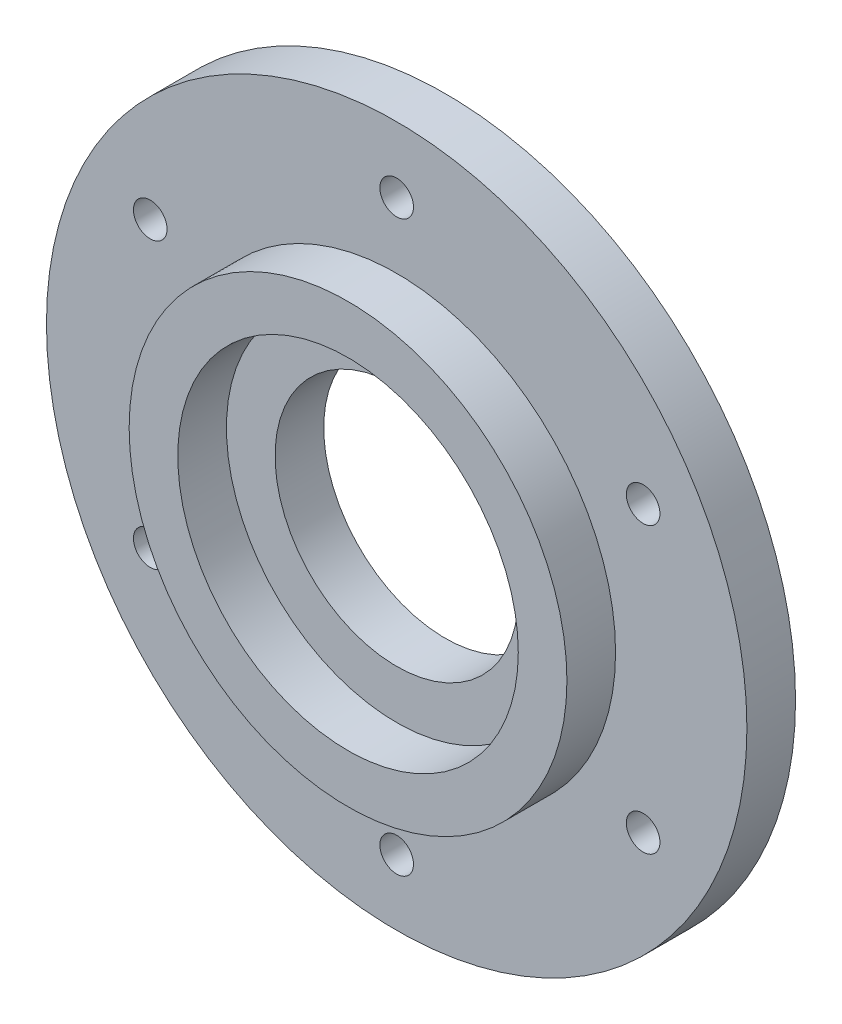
ISO-10303-21;
HEADER;
FILE_DESCRIPTION(('STEP AP214'),'2;1');
FILE_NAME('part.step','',(''),(''),'','','');
FILE_SCHEMA(('AUTOMOTIVE_DESIGN { 1 0 10303 214 1 1 1 1 }'));
ENDSEC;
DATA;
#1=APPLICATION_CONTEXT('core data for automotive mechanical design processes');
#2=APPLICATION_PROTOCOL_DEFINITION('international standard','automotive_design',2000,#1);
#3=PRODUCT_CONTEXT('',#1,'mechanical');
#4=PRODUCT('Part','Part','',(#3));
#5=PRODUCT_RELATED_PRODUCT_CATEGORY('part','',(#4));
#6=PRODUCT_DEFINITION_FORMATION('','',#4);
#7=PRODUCT_DEFINITION_CONTEXT('part definition',#1,'design');
#8=PRODUCT_DEFINITION('design','',#6,#7);
#9=PRODUCT_DEFINITION_SHAPE('','',#8);
#10=(LENGTH_UNIT() NAMED_UNIT(*) SI_UNIT(.MILLI.,.METRE.));
#11=(NAMED_UNIT(*) PLANE_ANGLE_UNIT() SI_UNIT($,.RADIAN.));
#12=(NAMED_UNIT(*) SI_UNIT($,.STERADIAN.) SOLID_ANGLE_UNIT());
#13=UNCERTAINTY_MEASURE_WITH_UNIT(LENGTH_MEASURE(1.E-05),#10,'distance_accuracy_value','');
#14=(GEOMETRIC_REPRESENTATION_CONTEXT(3) GLOBAL_UNCERTAINTY_ASSIGNED_CONTEXT((#13)) GLOBAL_UNIT_ASSIGNED_CONTEXT((#10,
#11,#12)) REPRESENTATION_CONTEXT('',''));
#15=CARTESIAN_POINT('',(0.,0.,0.));
#16=DIRECTION('',(0.,0.,1.));
#17=DIRECTION('',(1.,0.,0.));
#18=AXIS2_PLACEMENT_3D('',#15,#16,#17);
#19=CARTESIAN_POINT('',(0.,0.,1000.));
#20=DIRECTION('',(0.,0.,1.));
#21=DIRECTION('',(1.,0.,0.));
#22=AXIS2_PLACEMENT_3D('',#19,#20,#21);
#23=CYLINDRICAL_SURFACE('',#22,22.5);
#24=CARTESIAN_POINT('',(0.,0.,24.2));
#25=DIRECTION('',(0.,0.,1.));
#26=DIRECTION('',(1.,0.,0.));
#27=AXIS2_PLACEMENT_3D('',#24,#25,#26);
#28=CIRCLE('',#27,22.5);
#29=CARTESIAN_POINT('',(22.5,0.,24.2));
#30=VERTEX_POINT('',#29);
#31=EDGE_CURVE('E143',#30,#30,#28,.T.);
#32=ORIENTED_EDGE('',*,*,#31,.T.);
#33=EDGE_LOOP('',(#32));
#34=FACE_BOUND('',#33,.T.);
#35=CARTESIAN_POINT('',(0.,0.,29.2));
#36=DIRECTION('',(0.,0.,1.));
#37=DIRECTION('',(1.,0.,0.));
#38=AXIS2_PLACEMENT_3D('',#35,#36,#37);
#39=CIRCLE('',#38,22.5);
#40=CARTESIAN_POINT('',(22.5,0.,29.2));
#41=VERTEX_POINT('',#40);
#42=EDGE_CURVE('E10',#41,#41,#39,.T.);
#43=ORIENTED_EDGE('',*,*,#42,.F.);
#44=EDGE_LOOP('',(#43));
#45=FACE_BOUND('',#44,.T.);
#46=ADVANCED_FACE('F39',(#34,#45),#23,.T.);
#47=CARTESIAN_POINT('',(0.,0.,29.2));
#48=DIRECTION('',(0.,0.,1.));
#49=DIRECTION('',(1.,0.,0.));
#50=AXIS2_PLACEMENT_3D('',#47,#48,#49);
#51=PLANE('',#50);
#52=ORIENTED_EDGE('',*,*,#42,.T.);
#53=EDGE_LOOP('',(#52));
#54=FACE_BOUND('',#53,.T.);
#55=CARTESIAN_POINT('',(0.,0.,29.2));
#56=DIRECTION('',(0.,0.,1.));
#57=DIRECTION('',(1.,0.,0.));
#58=AXIS2_PLACEMENT_3D('',#55,#56,#57);
#59=CIRCLE('',#58,17.5);
#60=CARTESIAN_POINT('',(17.5,0.,29.2));
#61=VERTEX_POINT('',#60);
#62=EDGE_CURVE('E47',#61,#61,#59,.T.);
#63=ORIENTED_EDGE('',*,*,#62,.F.);
#64=EDGE_LOOP('',(#63));
#65=FACE_BOUND('',#64,.T.);
#66=ADVANCED_FACE('F165',(#54,#65),#51,.T.);
#67=CARTESIAN_POINT('',(0.,0.,1000.));
#68=DIRECTION('',(0.,0.,1.));
#69=DIRECTION('',(1.,0.,0.));
#70=AXIS2_PLACEMENT_3D('',#67,#68,#69);
#71=CYLINDRICAL_SURFACE('',#70,17.5);
#72=ORIENTED_EDGE('',*,*,#62,.T.);
#73=EDGE_LOOP('',(#72));
#74=FACE_BOUND('',#73,.T.);
#75=CARTESIAN_POINT('',(0.,0.,24.2));
#76=DIRECTION('',(0.,0.,1.));
#77=DIRECTION('',(1.,0.,0.));
#78=AXIS2_PLACEMENT_3D('',#75,#76,#77);
#79=CIRCLE('',#78,17.5);
#80=CARTESIAN_POINT('',(17.5,0.,24.2));
#81=VERTEX_POINT('',#80);
#82=EDGE_CURVE('E53',#81,#81,#79,.T.);
#83=ORIENTED_EDGE('',*,*,#82,.F.);
#84=EDGE_LOOP('',(#83));
#85=FACE_BOUND('',#84,.T.);
#86=ADVANCED_FACE('F163',(#74,#85),#71,.F.);
#87=CARTESIAN_POINT('',(0.,0.,24.2));
#88=DIRECTION('',(0.,0.,1.));
#89=DIRECTION('',(1.,0.,0.));
#90=AXIS2_PLACEMENT_3D('',#87,#88,#89);
#91=PLANE('',#90);
#92=CARTESIAN_POINT('',(0.,0.,24.2));
#93=DIRECTION('',(0.,0.,1.));
#94=DIRECTION('',(1.,0.,0.));
#95=AXIS2_PLACEMENT_3D('',#92,#93,#94);
#96=CIRCLE('',#95,12.5);
#97=CARTESIAN_POINT('',(12.5,0.,24.2));
#98=VERTEX_POINT('',#97);
#99=EDGE_CURVE('E61',#98,#98,#96,.T.);
#100=ORIENTED_EDGE('',*,*,#99,.F.);
#101=EDGE_LOOP('',(#100));
#102=FACE_BOUND('',#101,.T.);
#103=ORIENTED_EDGE('',*,*,#82,.T.);
#104=EDGE_LOOP('',(#103));
#105=FACE_BOUND('',#104,.T.);
#106=ADVANCED_FACE('F161',(#102,#105),#91,.T.);
#107=CARTESIAN_POINT('',(0.,0.,19.2));
#108=DIRECTION('',(0.,0.,-1.));
#109=DIRECTION('',(-1.,0.,0.));
#110=AXIS2_PLACEMENT_3D('',#107,#108,#109);
#111=PLANE('',#110);
#112=CARTESIAN_POINT('',(25.3312430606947,14.6250000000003,19.2));
#113=DIRECTION('',(0.,0.,-1.));
#114=DIRECTION('',(-1.,0.,0.));
#115=AXIS2_PLACEMENT_3D('',#112,#113,#114);
#116=CIRCLE('',#115,3.77063);
#117=CARTESIAN_POINT('',(21.5606130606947,14.6250000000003,19.2));
#118=VERTEX_POINT('',#117);
#119=EDGE_CURVE('E208',#118,#118,#116,.T.);
#120=ORIENTED_EDGE('',*,*,#119,.F.);
#121=EDGE_LOOP('',(#120));
#122=FACE_BOUND('',#121,.T.);
#123=CARTESIAN_POINT('',(25.331243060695,-14.6249999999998,19.2));
#124=DIRECTION('',(0.,0.,-1.));
#125=DIRECTION('',(-1.,0.,0.));
#126=AXIS2_PLACEMENT_3D('',#123,#124,#125);
#127=CIRCLE('',#126,3.77063);
#128=CARTESIAN_POINT('',(21.560613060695,-14.6249999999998,19.2));
#129=VERTEX_POINT('',#128);
#130=EDGE_CURVE('E99',#129,#129,#127,.T.);
#131=ORIENTED_EDGE('',*,*,#130,.F.);
#132=EDGE_LOOP('',(#131));
#133=FACE_BOUND('',#132,.T.);
#134=CARTESIAN_POINT('',(0.,-29.25,19.2));
#135=DIRECTION('',(0.,0.,-1.));
#136=DIRECTION('',(-1.,0.,0.));
#137=AXIS2_PLACEMENT_3D('',#134,#135,#136);
#138=CIRCLE('',#137,3.77063);
#139=CARTESIAN_POINT('',(-3.77063,-29.25,19.2));
#140=VERTEX_POINT('',#139);
#141=EDGE_CURVE('E83',#140,#140,#138,.T.);
#142=ORIENTED_EDGE('',*,*,#141,.F.);
#143=EDGE_LOOP('',(#142));
#144=FACE_BOUND('',#143,.T.);
#145=CARTESIAN_POINT('',(-25.3312430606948,-14.6250000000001,19.2));
#146=DIRECTION('',(0.,0.,-1.));
#147=DIRECTION('',(-1.,0.,0.));
#148=AXIS2_PLACEMENT_3D('',#145,#146,#147);
#149=CIRCLE('',#148,3.77063);
#150=CARTESIAN_POINT('',(-29.1018730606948,-14.6250000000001,19.2));
#151=VERTEX_POINT('',#150);
#152=EDGE_CURVE('E78',#151,#151,#149,.T.);
#153=ORIENTED_EDGE('',*,*,#152,.F.);
#154=EDGE_LOOP('',(#153));
#155=FACE_BOUND('',#154,.T.);
#156=CARTESIAN_POINT('',(-25.3312430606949,14.6249999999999,19.2));
#157=DIRECTION('',(0.,0.,-1.));
#158=DIRECTION('',(-1.,0.,0.));
#159=AXIS2_PLACEMENT_3D('',#156,#157,#158);
#160=CIRCLE('',#159,3.77063);
#161=CARTESIAN_POINT('',(-29.1018730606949,14.6249999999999,19.2));
#162=VERTEX_POINT('',#161);
#163=EDGE_CURVE('E73',#162,#162,#160,.T.);
#164=ORIENTED_EDGE('',*,*,#163,.F.);
#165=EDGE_LOOP('',(#164));
#166=FACE_BOUND('',#165,.T.);
#167=CARTESIAN_POINT('',(0.,29.25,19.2));
#168=DIRECTION('',(0.,0.,-1.));
#169=DIRECTION('',(-1.,0.,0.));
#170=AXIS2_PLACEMENT_3D('',#167,#168,#169);
#171=CIRCLE('',#170,3.77063);
#172=CARTESIAN_POINT('',(-3.77063,29.25,19.2));
#173=VERTEX_POINT('',#172);
#174=EDGE_CURVE('E67',#173,#173,#171,.T.);
#175=ORIENTED_EDGE('',*,*,#174,.F.);
#176=EDGE_LOOP('',(#175));
#177=FACE_BOUND('',#176,.T.);
#178=CARTESIAN_POINT('',(0.,0.,19.2));
#179=DIRECTION('',(0.,0.,1.));
#180=DIRECTION('',(1.,0.,0.));
#181=AXIS2_PLACEMENT_3D('',#178,#179,#180);
#182=CIRCLE('',#181,12.5);
#183=CARTESIAN_POINT('',(12.5,0.,19.2));
#184=VERTEX_POINT('',#183);
#185=EDGE_CURVE('E139',#184,#184,#182,.T.);
#186=ORIENTED_EDGE('',*,*,#185,.T.);
#187=EDGE_LOOP('',(#186));
#188=FACE_BOUND('',#187,.T.);
#189=CARTESIAN_POINT('',(0.,0.,19.2));
#190=DIRECTION('',(0.,0.,1.));
#191=DIRECTION('',(1.,0.,0.));
#192=AXIS2_PLACEMENT_3D('',#189,#190,#191);
#193=CIRCLE('',#192,36.);
#194=CARTESIAN_POINT('',(36.,0.,19.2));
#195=VERTEX_POINT('',#194);
#196=EDGE_CURVE('E154',#195,#195,#193,.T.);
#197=ORIENTED_EDGE('',*,*,#196,.F.);
#198=EDGE_LOOP('',(#197));
#199=FACE_BOUND('',#198,.T.);
#200=ADVANCED_FACE('F172',(#122,#133,#144,#155,#166,#177,#188,#199),#111,.T.);
#201=CARTESIAN_POINT('',(0.,0.,1000.));
#202=DIRECTION('',(0.,0.,1.));
#203=DIRECTION('',(1.,0.,0.));
#204=AXIS2_PLACEMENT_3D('',#201,#202,#203);
#205=CYLINDRICAL_SURFACE('',#204,36.);
#206=ORIENTED_EDGE('',*,*,#196,.T.);
#207=EDGE_LOOP('',(#206));
#208=FACE_BOUND('',#207,.T.);
#209=CARTESIAN_POINT('',(0.,0.,24.2));
#210=DIRECTION('',(0.,0.,1.));
#211=DIRECTION('',(1.,0.,0.));
#212=AXIS2_PLACEMENT_3D('',#209,#210,#211);
#213=CIRCLE('',#212,36.);
#214=CARTESIAN_POINT('',(36.,0.,24.2));
#215=VERTEX_POINT('',#214);
#216=EDGE_CURVE('E150',#215,#215,#213,.T.);
#217=ORIENTED_EDGE('',*,*,#216,.F.);
#218=EDGE_LOOP('',(#217));
#219=FACE_BOUND('',#218,.T.);
#220=ADVANCED_FACE('F185',(#208,#219),#205,.T.);
#221=CARTESIAN_POINT('',(0.,0.,24.2));
#222=DIRECTION('',(0.,0.,1.));
#223=DIRECTION('',(1.,0.,0.));
#224=AXIS2_PLACEMENT_3D('',#221,#222,#223);
#225=PLANE('',#224);
#226=CARTESIAN_POINT('',(25.3312430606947,14.6250000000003,24.2));
#227=DIRECTION('',(0.,0.,1.));
#228=DIRECTION('',(1.,0.,0.));
#229=AXIS2_PLACEMENT_3D('',#226,#227,#228);
#230=CIRCLE('',#229,1.7272);
#231=CARTESIAN_POINT('',(27.0584430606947,14.6250000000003,24.2));
#232=VERTEX_POINT('',#231);
#233=EDGE_CURVE('E42',#232,#232,#230,.T.);
#234=ORIENTED_EDGE('',*,*,#233,.F.);
#235=EDGE_LOOP('',(#234));
#236=FACE_BOUND('',#235,.T.);
#237=CARTESIAN_POINT('',(25.331243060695,-14.6249999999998,24.2));
#238=DIRECTION('',(0.,0.,1.));
#239=DIRECTION('',(1.,0.,0.));
#240=AXIS2_PLACEMENT_3D('',#237,#238,#239);
#241=CIRCLE('',#240,1.7272);
#242=CARTESIAN_POINT('',(27.058443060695,-14.6249999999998,24.2));
#243=VERTEX_POINT('',#242);
#244=EDGE_CURVE('E80',#243,#243,#241,.T.);
#245=ORIENTED_EDGE('',*,*,#244,.F.);
#246=EDGE_LOOP('',(#245));
#247=FACE_BOUND('',#246,.T.);
#248=CARTESIAN_POINT('',(0.,-29.25,24.2));
#249=DIRECTION('',(0.,0.,1.));
#250=DIRECTION('',(1.,0.,0.));
#251=AXIS2_PLACEMENT_3D('',#248,#249,#250);
#252=CIRCLE('',#251,1.7272);
#253=CARTESIAN_POINT('',(1.7272,-29.25,24.2));
#254=VERTEX_POINT('',#253);
#255=EDGE_CURVE('E75',#254,#254,#252,.T.);
#256=ORIENTED_EDGE('',*,*,#255,.F.);
#257=EDGE_LOOP('',(#256));
#258=FACE_BOUND('',#257,.T.);
#259=CARTESIAN_POINT('',(-25.3312430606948,-14.6250000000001,24.2));
#260=DIRECTION('',(0.,0.,1.));
#261=DIRECTION('',(1.,0.,0.));
#262=AXIS2_PLACEMENT_3D('',#259,#260,#261);
#263=CIRCLE('',#262,1.7272);
#264=CARTESIAN_POINT('',(-23.6040430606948,-14.6250000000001,24.2));
#265=VERTEX_POINT('',#264);
#266=EDGE_CURVE('E69',#265,#265,#263,.T.);
#267=ORIENTED_EDGE('',*,*,#266,.F.);
#268=EDGE_LOOP('',(#267));
#269=FACE_BOUND('',#268,.T.);
#270=CARTESIAN_POINT('',(-25.3312430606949,14.6249999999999,24.2));
#271=DIRECTION('',(0.,0.,1.));
#272=DIRECTION('',(1.,0.,0.));
#273=AXIS2_PLACEMENT_3D('',#270,#271,#272);
#274=CIRCLE('',#273,1.7272);
#275=CARTESIAN_POINT('',(-23.6040430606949,14.6249999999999,24.2));
#276=VERTEX_POINT('',#275);
#277=EDGE_CURVE('E63',#276,#276,#274,.T.);
#278=ORIENTED_EDGE('',*,*,#277,.F.);
#279=EDGE_LOOP('',(#278));
#280=FACE_BOUND('',#279,.T.);
#281=CARTESIAN_POINT('',(0.,29.25,24.2));
#282=DIRECTION('',(0.,0.,1.));
#283=DIRECTION('',(1.,0.,0.));
#284=AXIS2_PLACEMENT_3D('',#281,#282,#283);
#285=CIRCLE('',#284,1.7272);
#286=CARTESIAN_POINT('',(1.7272,29.25,24.2));
#287=VERTEX_POINT('',#286);
#288=EDGE_CURVE('E57',#287,#287,#285,.T.);
#289=ORIENTED_EDGE('',*,*,#288,.F.);
#290=EDGE_LOOP('',(#289));
#291=FACE_BOUND('',#290,.T.);
#292=ORIENTED_EDGE('',*,*,#216,.T.);
#293=EDGE_LOOP('',(#292));
#294=FACE_BOUND('',#293,.T.);
#295=ORIENTED_EDGE('',*,*,#31,.F.);
#296=EDGE_LOOP('',(#295));
#297=FACE_BOUND('',#296,.T.);
#298=ADVANCED_FACE('F182',(#236,#247,#258,#269,#280,#291,#294,#297),#225,.T.);
#299=CARTESIAN_POINT('',(0.,0.,19.2));
#300=DIRECTION('',(0.,0.,1.));
#301=DIRECTION('',(1.,0.,0.));
#302=AXIS2_PLACEMENT_3D('',#299,#300,#301);
#303=CYLINDRICAL_SURFACE('',#302,12.5);
#304=ORIENTED_EDGE('',*,*,#185,.F.);
#305=EDGE_LOOP('',(#304));
#306=FACE_BOUND('',#305,.T.);
#307=ORIENTED_EDGE('',*,*,#99,.T.);
#308=EDGE_LOOP('',(#307));
#309=FACE_BOUND('',#308,.T.);
#310=ADVANCED_FACE('F184',(#306,#309),#303,.F.);
#311=CARTESIAN_POINT('',(0.,29.25,19.2));
#312=DIRECTION('',(0.,0.,-1.));
#313=DIRECTION('',(-1.,0.,0.));
#314=AXIS2_PLACEMENT_3D('',#311,#312,#313);
#315=CYLINDRICAL_SURFACE('',#314,1.7272);
#316=ORIENTED_EDGE('',*,*,#288,.T.);
#317=EDGE_LOOP('',(#316));
#318=FACE_BOUND('',#317,.T.);
#319=CARTESIAN_POINT('',(0.,29.25,21.1812));
#320=DIRECTION('',(0.,0.,-1.));
#321=DIRECTION('',(-1.,0.,0.));
#322=AXIS2_PLACEMENT_3D('',#319,#320,#321);
#323=CIRCLE('',#322,1.7272);
#324=CARTESIAN_POINT('',(-1.7272,29.25,21.1812));
#325=VERTEX_POINT('',#324);
#326=EDGE_CURVE('E62',#325,#325,#323,.T.);
#327=ORIENTED_EDGE('',*,*,#326,.T.);
#328=EDGE_LOOP('',(#327));
#329=FACE_BOUND('',#328,.T.);
#330=ADVANCED_FACE('F192',(#318,#329),#315,.F.);
#331=CARTESIAN_POINT('',(1.7272,29.25,21.1812));
#332=DIRECTION('',(0.,0.,1.));
#333=DIRECTION('',(1.,0.,0.));
#334=AXIS2_PLACEMENT_3D('',#331,#332,#333);
#335=PLANE('',#334);
#336=ORIENTED_EDGE('',*,*,#326,.F.);
#337=EDGE_LOOP('',(#336));
#338=FACE_BOUND('',#337,.T.);
#339=CARTESIAN_POINT('',(0.,29.25,21.1812));
#340=DIRECTION('',(0.,0.,-1.));
#341=DIRECTION('',(-1.,0.,0.));
#342=AXIS2_PLACEMENT_3D('',#339,#340,#341);
#343=CIRCLE('',#342,3.77063);
#344=CARTESIAN_POINT('',(-3.77063,29.25,21.1812));
#345=VERTEX_POINT('',#344);
#346=EDGE_CURVE('E132',#345,#345,#343,.T.);
#347=ORIENTED_EDGE('',*,*,#346,.T.);
#348=EDGE_LOOP('',(#347));
#349=FACE_BOUND('',#348,.T.);
#350=ADVANCED_FACE('F232',(#338,#349),#335,.F.);
#351=CARTESIAN_POINT('',(0.,29.25,19.2));
#352=DIRECTION('',(0.,0.,-1.));
#353=DIRECTION('',(-1.,0.,0.));
#354=AXIS2_PLACEMENT_3D('',#351,#352,#353);
#355=CYLINDRICAL_SURFACE('',#354,3.77063);
#356=ORIENTED_EDGE('',*,*,#346,.F.);
#357=EDGE_LOOP('',(#356));
#358=FACE_BOUND('',#357,.T.);
#359=ORIENTED_EDGE('',*,*,#174,.T.);
#360=EDGE_LOOP('',(#359));
#361=FACE_BOUND('',#360,.T.);
#362=ADVANCED_FACE('F229',(#358,#361),#355,.F.);
#363=CARTESIAN_POINT('',(-25.3312430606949,14.6249999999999,19.2));
#364=DIRECTION('',(0.,0.,-1.));
#365=DIRECTION('',(-1.,0.,0.));
#366=AXIS2_PLACEMENT_3D('',#363,#364,#365);
#367=CYLINDRICAL_SURFACE('',#366,1.7272);
#368=ORIENTED_EDGE('',*,*,#277,.T.);
#369=EDGE_LOOP('',(#368));
#370=FACE_BOUND('',#369,.T.);
#371=CARTESIAN_POINT('',(-25.3312430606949,14.6249999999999,21.1812));
#372=DIRECTION('',(0.,0.,-1.));
#373=DIRECTION('',(-1.,0.,0.));
#374=AXIS2_PLACEMENT_3D('',#371,#372,#373);
#375=CIRCLE('',#374,1.7272);
#376=CARTESIAN_POINT('',(-27.0584430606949,14.6249999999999,21.1812));
#377=VERTEX_POINT('',#376);
#378=EDGE_CURVE('E68',#377,#377,#375,.T.);
#379=ORIENTED_EDGE('',*,*,#378,.T.);
#380=EDGE_LOOP('',(#379));
#381=FACE_BOUND('',#380,.T.);
#382=ADVANCED_FACE('F231',(#370,#381),#367,.F.);
#383=CARTESIAN_POINT('',(-23.6040430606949,14.6249999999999,21.1812));
#384=DIRECTION('',(0.,0.,1.));
#385=DIRECTION('',(1.,0.,0.));
#386=AXIS2_PLACEMENT_3D('',#383,#384,#385);
#387=PLANE('',#386);
#388=ORIENTED_EDGE('',*,*,#378,.F.);
#389=EDGE_LOOP('',(#388));
#390=FACE_BOUND('',#389,.T.);
#391=CARTESIAN_POINT('',(-25.3312430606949,14.6249999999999,21.1812));
#392=DIRECTION('',(0.,0.,-1.));
#393=DIRECTION('',(-1.,0.,0.));
#394=AXIS2_PLACEMENT_3D('',#391,#392,#393);
#395=CIRCLE('',#394,3.77063);
#396=CARTESIAN_POINT('',(-29.1018730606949,14.6249999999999,21.1812));
#397=VERTEX_POINT('',#396);
#398=EDGE_CURVE('E122',#397,#397,#395,.T.);
#399=ORIENTED_EDGE('',*,*,#398,.T.);
#400=EDGE_LOOP('',(#399));
#401=FACE_BOUND('',#400,.T.);
#402=ADVANCED_FACE('F239',(#390,#401),#387,.F.);
#403=CARTESIAN_POINT('',(-25.3312430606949,14.6249999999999,19.2));
#404=DIRECTION('',(0.,0.,-1.));
#405=DIRECTION('',(-1.,0.,0.));
#406=AXIS2_PLACEMENT_3D('',#403,#404,#405);
#407=CYLINDRICAL_SURFACE('',#406,3.77063);
#408=ORIENTED_EDGE('',*,*,#398,.F.);
#409=EDGE_LOOP('',(#408));
#410=FACE_BOUND('',#409,.T.);
#411=ORIENTED_EDGE('',*,*,#163,.T.);
#412=EDGE_LOOP('',(#411));
#413=FACE_BOUND('',#412,.T.);
#414=ADVANCED_FACE('F291',(#410,#413),#407,.F.);
#415=CARTESIAN_POINT('',(-25.3312430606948,-14.6250000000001,19.2));
#416=DIRECTION('',(0.,0.,-1.));
#417=DIRECTION('',(-1.,0.,0.));
#418=AXIS2_PLACEMENT_3D('',#415,#416,#417);
#419=CYLINDRICAL_SURFACE('',#418,1.7272);
#420=ORIENTED_EDGE('',*,*,#266,.T.);
#421=EDGE_LOOP('',(#420));
#422=FACE_BOUND('',#421,.T.);
#423=CARTESIAN_POINT('',(-25.3312430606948,-14.6250000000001,21.1812));
#424=DIRECTION('',(0.,0.,-1.));
#425=DIRECTION('',(-1.,0.,0.));
#426=AXIS2_PLACEMENT_3D('',#423,#424,#425);
#427=CIRCLE('',#426,1.7272);
#428=CARTESIAN_POINT('',(-27.0584430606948,-14.6250000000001,21.1812));
#429=VERTEX_POINT('',#428);
#430=EDGE_CURVE('E74',#429,#429,#427,.T.);
#431=ORIENTED_EDGE('',*,*,#430,.T.);
#432=EDGE_LOOP('',(#431));
#433=FACE_BOUND('',#432,.T.);
#434=ADVANCED_FACE('F300',(#422,#433),#419,.F.);
#435=CARTESIAN_POINT('',(-23.6040430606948,-14.6250000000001,21.1812));
#436=DIRECTION('',(0.,0.,1.));
#437=DIRECTION('',(1.,0.,0.));
#438=AXIS2_PLACEMENT_3D('',#435,#436,#437);
#439=PLANE('',#438);
#440=ORIENTED_EDGE('',*,*,#430,.F.);
#441=EDGE_LOOP('',(#440));
#442=FACE_BOUND('',#441,.T.);
#443=CARTESIAN_POINT('',(-25.3312430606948,-14.6250000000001,21.1812));
#444=DIRECTION('',(0.,0.,-1.));
#445=DIRECTION('',(-1.,0.,0.));
#446=AXIS2_PLACEMENT_3D('',#443,#444,#445);
#447=CIRCLE('',#446,3.77063);
#448=CARTESIAN_POINT('',(-29.1018730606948,-14.6250000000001,21.1812));
#449=VERTEX_POINT('',#448);
#450=EDGE_CURVE('E112',#449,#449,#447,.T.);
#451=ORIENTED_EDGE('',*,*,#450,.T.);
#452=EDGE_LOOP('',(#451));
#453=FACE_BOUND('',#452,.T.);
#454=ADVANCED_FACE('F310',(#442,#453),#439,.F.);
#455=CARTESIAN_POINT('',(-25.3312430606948,-14.6250000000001,19.2));
#456=DIRECTION('',(0.,0.,-1.));
#457=DIRECTION('',(-1.,0.,0.));
#458=AXIS2_PLACEMENT_3D('',#455,#456,#457);
#459=CYLINDRICAL_SURFACE('',#458,3.77063);
#460=ORIENTED_EDGE('',*,*,#450,.F.);
#461=EDGE_LOOP('',(#460));
#462=FACE_BOUND('',#461,.T.);
#463=ORIENTED_EDGE('',*,*,#152,.T.);
#464=EDGE_LOOP('',(#463));
#465=FACE_BOUND('',#464,.T.);
#466=ADVANCED_FACE('F320',(#462,#465),#459,.F.);
#467=CARTESIAN_POINT('',(0.,-29.25,19.2));
#468=DIRECTION('',(0.,0.,-1.));
#469=DIRECTION('',(-1.,0.,0.));
#470=AXIS2_PLACEMENT_3D('',#467,#468,#469);
#471=CYLINDRICAL_SURFACE('',#470,1.7272);
#472=ORIENTED_EDGE('',*,*,#255,.T.);
#473=EDGE_LOOP('',(#472));
#474=FACE_BOUND('',#473,.T.);
#475=CARTESIAN_POINT('',(0.,-29.25,21.1812));
#476=DIRECTION('',(0.,0.,-1.));
#477=DIRECTION('',(-1.,0.,0.));
#478=AXIS2_PLACEMENT_3D('',#475,#476,#477);
#479=CIRCLE('',#478,1.7272);
#480=CARTESIAN_POINT('',(-1.7272,-29.25,21.1812));
#481=VERTEX_POINT('',#480);
#482=EDGE_CURVE('E79',#481,#481,#479,.T.);
#483=ORIENTED_EDGE('',*,*,#482,.T.);
#484=EDGE_LOOP('',(#483));
#485=FACE_BOUND('',#484,.T.);
#486=ADVANCED_FACE('F330',(#474,#485),#471,.F.);
#487=CARTESIAN_POINT('',(1.7272,-29.25,21.1812));
#488=DIRECTION('',(0.,0.,1.));
#489=DIRECTION('',(1.,0.,0.));
#490=AXIS2_PLACEMENT_3D('',#487,#488,#489);
#491=PLANE('',#490);
#492=ORIENTED_EDGE('',*,*,#482,.F.);
#493=EDGE_LOOP('',(#492));
#494=FACE_BOUND('',#493,.T.);
#495=CARTESIAN_POINT('',(0.,-29.25,21.1812));
#496=DIRECTION('',(0.,0.,-1.));
#497=DIRECTION('',(-1.,0.,0.));
#498=AXIS2_PLACEMENT_3D('',#495,#496,#497);
#499=CIRCLE('',#498,3.77063);
#500=CARTESIAN_POINT('',(-3.77063,-29.25,21.1812));
#501=VERTEX_POINT('',#500);
#502=EDGE_CURVE('E90',#501,#501,#499,.T.);
#503=ORIENTED_EDGE('',*,*,#502,.T.);
#504=EDGE_LOOP('',(#503));
#505=FACE_BOUND('',#504,.T.);
#506=ADVANCED_FACE('F340',(#494,#505),#491,.F.);
#507=CARTESIAN_POINT('',(0.,-29.25,19.2));
#508=DIRECTION('',(0.,0.,-1.));
#509=DIRECTION('',(-1.,0.,0.));
#510=AXIS2_PLACEMENT_3D('',#507,#508,#509);
#511=CYLINDRICAL_SURFACE('',#510,3.77063);
#512=ORIENTED_EDGE('',*,*,#502,.F.);
#513=EDGE_LOOP('',(#512));
#514=FACE_BOUND('',#513,.T.);
#515=ORIENTED_EDGE('',*,*,#141,.T.);
#516=EDGE_LOOP('',(#515));
#517=FACE_BOUND('',#516,.T.);
#518=ADVANCED_FACE('F350',(#514,#517),#511,.F.);
#519=CARTESIAN_POINT('',(25.331243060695,-14.6249999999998,19.2));
#520=DIRECTION('',(0.,0.,-1.));
#521=DIRECTION('',(-1.,0.,0.));
#522=AXIS2_PLACEMENT_3D('',#519,#520,#521);
#523=CYLINDRICAL_SURFACE('',#522,1.7272);
#524=ORIENTED_EDGE('',*,*,#244,.T.);
#525=EDGE_LOOP('',(#524));
#526=FACE_BOUND('',#525,.T.);
#527=CARTESIAN_POINT('',(25.331243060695,-14.6249999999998,21.1812));
#528=DIRECTION('',(0.,0.,-1.));
#529=DIRECTION('',(-1.,0.,0.));
#530=AXIS2_PLACEMENT_3D('',#527,#528,#529);
#531=CIRCLE('',#530,1.7272);
#532=CARTESIAN_POINT('',(23.604043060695,-14.6249999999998,21.1812));
#533=VERTEX_POINT('',#532);
#534=EDGE_CURVE('E84',#533,#533,#531,.T.);
#535=ORIENTED_EDGE('',*,*,#534,.T.);
#536=EDGE_LOOP('',(#535));
#537=FACE_BOUND('',#536,.T.);
#538=ADVANCED_FACE('F360',(#526,#537),#523,.F.);
#539=CARTESIAN_POINT('',(27.058443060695,-14.6249999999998,21.1812));
#540=DIRECTION('',(0.,0.,1.));
#541=DIRECTION('',(1.,0.,0.));
#542=AXIS2_PLACEMENT_3D('',#539,#540,#541);
#543=PLANE('',#542);
#544=ORIENTED_EDGE('',*,*,#534,.F.);
#545=EDGE_LOOP('',(#544));
#546=FACE_BOUND('',#545,.T.);
#547=CARTESIAN_POINT('',(25.331243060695,-14.6249999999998,21.1812));
#548=DIRECTION('',(0.,0.,-1.));
#549=DIRECTION('',(-1.,0.,0.));
#550=AXIS2_PLACEMENT_3D('',#547,#548,#549);
#551=CIRCLE('',#550,3.77063);
#552=CARTESIAN_POINT('',(21.560613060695,-14.6249999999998,21.1812));
#553=VERTEX_POINT('',#552);
#554=EDGE_CURVE('E93',#553,#553,#551,.T.);
#555=ORIENTED_EDGE('',*,*,#554,.T.);
#556=EDGE_LOOP('',(#555));
#557=FACE_BOUND('',#556,.T.);
#558=ADVANCED_FACE('F370',(#546,#557),#543,.F.);
#559=CARTESIAN_POINT('',(25.331243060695,-14.6249999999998,19.2));
#560=DIRECTION('',(0.,0.,-1.));
#561=DIRECTION('',(-1.,0.,0.));
#562=AXIS2_PLACEMENT_3D('',#559,#560,#561);
#563=CYLINDRICAL_SURFACE('',#562,3.77063);
#564=ORIENTED_EDGE('',*,*,#554,.F.);
#565=EDGE_LOOP('',(#564));
#566=FACE_BOUND('',#565,.T.);
#567=ORIENTED_EDGE('',*,*,#130,.T.);
#568=EDGE_LOOP('',(#567));
#569=FACE_BOUND('',#568,.T.);
#570=ADVANCED_FACE('F379',(#566,#569),#563,.F.);
#571=CARTESIAN_POINT('',(25.3312430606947,14.6250000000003,19.2));
#572=DIRECTION('',(0.,0.,-1.));
#573=DIRECTION('',(-1.,0.,0.));
#574=AXIS2_PLACEMENT_3D('',#571,#572,#573);
#575=CYLINDRICAL_SURFACE('',#574,1.7272);
#576=ORIENTED_EDGE('',*,*,#233,.T.);
#577=EDGE_LOOP('',(#576));
#578=FACE_BOUND('',#577,.T.);
#579=CARTESIAN_POINT('',(25.3312430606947,14.6250000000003,21.1812));
#580=DIRECTION('',(0.,0.,-1.));
#581=DIRECTION('',(-1.,0.,0.));
#582=AXIS2_PLACEMENT_3D('',#579,#580,#581);
#583=CIRCLE('',#582,1.7272);
#584=CARTESIAN_POINT('',(23.6040430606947,14.6250000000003,21.1812));
#585=VERTEX_POINT('',#584);
#586=EDGE_CURVE('E430',#585,#585,#583,.T.);
#587=ORIENTED_EDGE('',*,*,#586,.T.);
#588=EDGE_LOOP('',(#587));
#589=FACE_BOUND('',#588,.T.);
#590=ADVANCED_FACE('F389',(#578,#589),#575,.F.);
#591=CARTESIAN_POINT('',(27.0584430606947,14.6250000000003,21.1812));
#592=DIRECTION('',(0.,0.,1.));
#593=DIRECTION('',(1.,0.,0.));
#594=AXIS2_PLACEMENT_3D('',#591,#592,#593);
#595=PLANE('',#594);
#596=ORIENTED_EDGE('',*,*,#586,.F.);
#597=EDGE_LOOP('',(#596));
#598=FACE_BOUND('',#597,.T.);
#599=CARTESIAN_POINT('',(25.3312430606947,14.6250000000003,21.1812));
#600=DIRECTION('',(0.,0.,-1.));
#601=DIRECTION('',(-1.,0.,0.));
#602=AXIS2_PLACEMENT_3D('',#599,#600,#601);
#603=CIRCLE('',#602,3.77063);
#604=CARTESIAN_POINT('',(21.5606130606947,14.6250000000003,21.1812));
#605=VERTEX_POINT('',#604);
#606=EDGE_CURVE('E426',#605,#605,#603,.T.);
#607=ORIENTED_EDGE('',*,*,#606,.T.);
#608=EDGE_LOOP('',(#607));
#609=FACE_BOUND('',#608,.T.);
#610=ADVANCED_FACE('F399',(#598,#609),#595,.F.);
#611=CARTESIAN_POINT('',(25.3312430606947,14.6250000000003,19.2));
#612=DIRECTION('',(0.,0.,-1.));
#613=DIRECTION('',(-1.,0.,0.));
#614=AXIS2_PLACEMENT_3D('',#611,#612,#613);
#615=CYLINDRICAL_SURFACE('',#614,3.77063);
#616=ORIENTED_EDGE('',*,*,#606,.F.);
#617=EDGE_LOOP('',(#616));
#618=FACE_BOUND('',#617,.T.);
#619=ORIENTED_EDGE('',*,*,#119,.T.);
#620=EDGE_LOOP('',(#619));
#621=FACE_BOUND('',#620,.T.);
#622=ADVANCED_FACE('F409',(#618,#621),#615,.F.);
#623=CLOSED_SHELL('',(#46,#66,#86,#106,#200,#220,#298,#310,#330,#350,#362,#382,#402,#414,#434,
#454,#466,#486,#506,#518,#538,#558,#570,#590,#610,#622));
#624=MANIFOLD_SOLID_BREP('B2',#623);
#625=ADVANCED_BREP_SHAPE_REPRESENTATION('',(#18,#624),#14);
#626=SHAPE_DEFINITION_REPRESENTATION(#9,#625);
ENDSEC;
END-ISO-10303-21;
